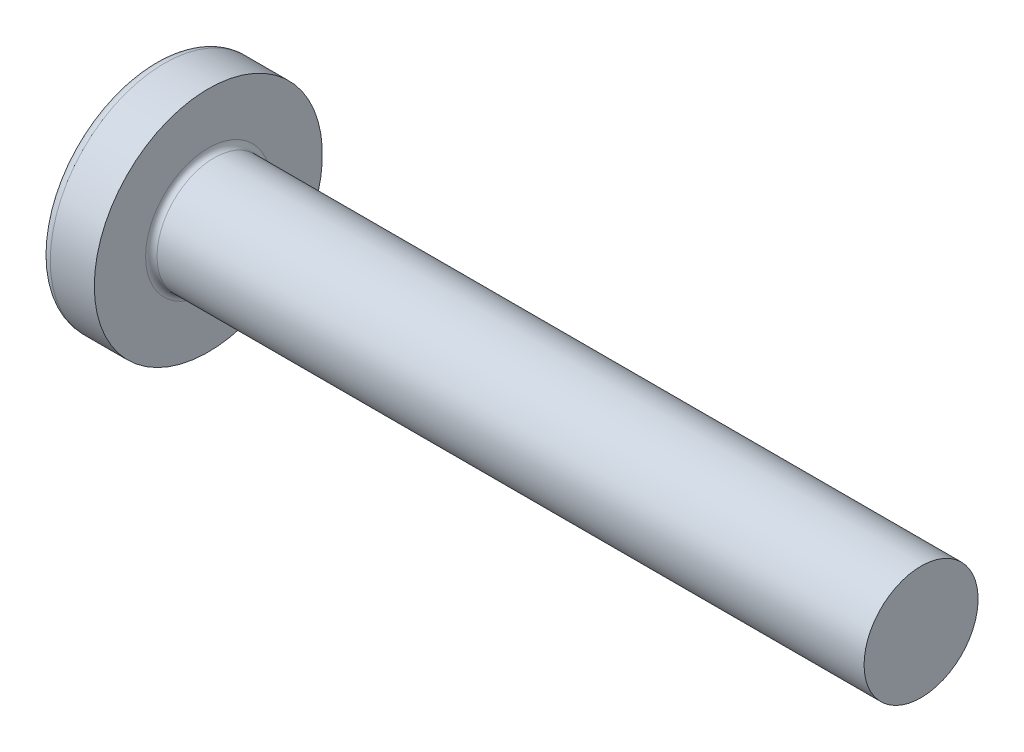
from build123d import *

# Parameters (mm, degrees)
FILLET1_R    = 0.2
RECPAT_COUNT = 2
RECPAT_ANGLE = 90


with BuildPart() as part:
    # BodySke → Base-Revolve (revolve)
    with BuildSketch(Plane.XY, mode=Mode.PRIVATE) as base_revolve_sk:
        with BuildLine():
            Line((3.1, 2), (3.1, 4))
            Line((3.1, 4), (1.555305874, 4))
            ThreePointArc((1.555305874, 4), (1.392873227, 3.961271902), (1.265388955, 3.853420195))
            ThreePointArc((1.265388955, 3.853420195), (0.324444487, 2.027933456), (0, 0))
            Line((0, 0), (28.1, 0))
            Line((28.1, 0), (28.1, 2))
            Line((28.1, 2), (3.1, 2))
        make_face()
    revolve(base_revolve_sk.sketch.rotate(Axis((1.555305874, 0, 0), (1, 0, 0)), 90), axis=Axis((1.555305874, 0, 0), (1, 0, 0)))

    # Fillet1
    fillet1_edges = [part.edges().sort_by_distance(p)[0] for p in [
        (3.1, 0, -2),
    ]]
    fillet(fillet1_edges, radius=FILLET1_R)

    # Sketch3 → Recess section 0
    with BuildSketch(Plane(origin=(0, 0, 0), x_dir=(0, 0, -1), z_dir=(1, 0, 0))):
        with BuildLine():
            Line((0.515, -2.15), (-0.515, -2.15))
            Line((-0.515, -2.15), (-0.515, 2.15))
            Line((-0.515, 2.15), (0.515, 2.15))
            Line((0.515, 2.15), (0.515, -2.15))
        make_face()
    # Sketch4 → Recess section 1
    with BuildSketch(Plane(origin=(2.34, 0, 0), x_dir=(0, 0, -1), z_dir=(1, 0, 0))):
        with BuildLine():
            Line((0.515, -0.983319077), (-0.515, -0.983319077))
            Line((-0.515, -0.983319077), (-0.515, 0.983319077))
            Line((-0.515, 0.983319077), (0.515, 0.983319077))
            Line((0.515, 0.983319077), (0.515, -0.983319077))
        make_face()
    recess = loft(mode=Mode.SUBTRACT)

    # RecPat: Recess ×2 about axis
    recpat_axis = Axis((0, 0, 0), (1, 0, 0))
    for i in range(1, RECPAT_COUNT):
        add(recess.rotate(recpat_axis, i * RECPAT_ANGLE / (RECPAT_COUNT - 1)), mode=Mode.SUBTRACT)

    # RecCorSke → RecessCore (revolve, cut)
    with BuildSketch(Plane.XY, mode=Mode.PRIVATE) as recesscore_sk:
        Polygon((0, 0), (0, 1.01462874), (2.34, 0.851), (2.616506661, 0), align=None)
    revolve(recesscore_sk.sketch.rotate(Axis((-3.175, 0, 0), (1, 0, 0)), 345.452408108), axis=Axis((-3.175, 0, 0), (1, 0, 0)), mode=Mode.SUBTRACT)


solid = part.part
